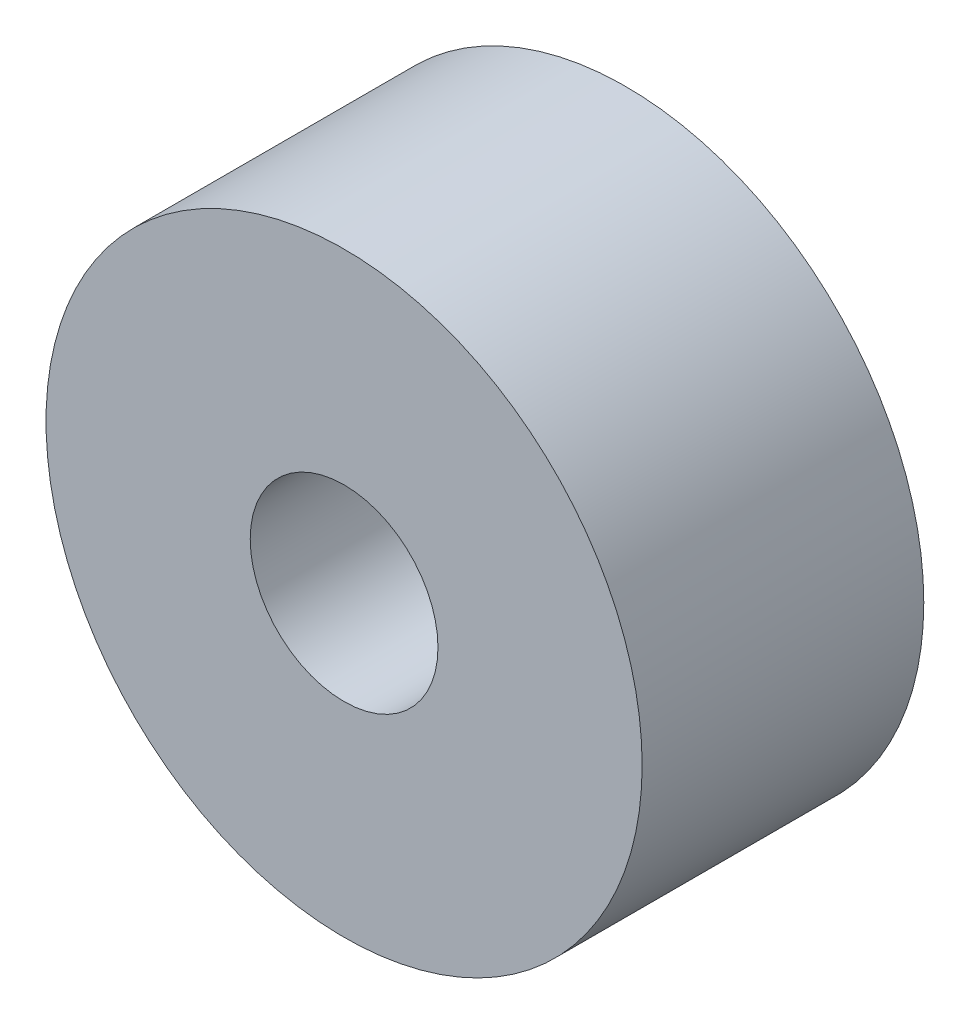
ISO-10303-21;
HEADER;
FILE_DESCRIPTION(('STEP AP214'),'2;1');
FILE_NAME('part.step','',(''),(''),'','','');
FILE_SCHEMA(('AUTOMOTIVE_DESIGN { 1 0 10303 214 1 1 1 1 }'));
ENDSEC;
DATA;
#1=APPLICATION_CONTEXT('core data for automotive mechanical design processes');
#2=APPLICATION_PROTOCOL_DEFINITION('international standard','automotive_design',2000,#1);
#3=PRODUCT_CONTEXT('',#1,'mechanical');
#4=PRODUCT('Part','Part','',(#3));
#5=PRODUCT_RELATED_PRODUCT_CATEGORY('part','',(#4));
#6=PRODUCT_DEFINITION_FORMATION('','',#4);
#7=PRODUCT_DEFINITION_CONTEXT('part definition',#1,'design');
#8=PRODUCT_DEFINITION('design','',#6,#7);
#9=PRODUCT_DEFINITION_SHAPE('','',#8);
#10=(LENGTH_UNIT() NAMED_UNIT(*) SI_UNIT(.MILLI.,.METRE.));
#11=(NAMED_UNIT(*) PLANE_ANGLE_UNIT() SI_UNIT($,.RADIAN.));
#12=(NAMED_UNIT(*) SI_UNIT($,.STERADIAN.) SOLID_ANGLE_UNIT());
#13=UNCERTAINTY_MEASURE_WITH_UNIT(LENGTH_MEASURE(1.E-05),#10,'distance_accuracy_value','');
#14=(GEOMETRIC_REPRESENTATION_CONTEXT(3) GLOBAL_UNCERTAINTY_ASSIGNED_CONTEXT((#13)) GLOBAL_UNIT_ASSIGNED_CONTEXT((#10,
#11,#12)) REPRESENTATION_CONTEXT('',''));
#15=CARTESIAN_POINT('',(0.,0.,0.));
#16=DIRECTION('',(0.,0.,1.));
#17=DIRECTION('',(1.,0.,0.));
#18=AXIS2_PLACEMENT_3D('',#15,#16,#17);
#19=CARTESIAN_POINT('',(0.,0.,3.));
#20=DIRECTION('',(0.,0.,1.));
#21=DIRECTION('',(1.,0.,0.));
#22=AXIS2_PLACEMENT_3D('',#19,#20,#21);
#23=PLANE('',#22);
#24=CARTESIAN_POINT('',(0.,0.,3.));
#25=DIRECTION('',(0.,0.,1.));
#26=DIRECTION('',(1.,0.,0.));
#27=AXIS2_PLACEMENT_3D('',#24,#25,#26);
#28=CIRCLE('',#27,3.175);
#29=CARTESIAN_POINT('',(3.175,0.,3.));
#30=VERTEX_POINT('',#29);
#31=EDGE_CURVE('E10',#30,#30,#28,.T.);
#32=ORIENTED_EDGE('',*,*,#31,.T.);
#33=EDGE_LOOP('',(#32));
#34=FACE_BOUND('',#33,.T.);
#35=CARTESIAN_POINT('',(0.,0.,3.));
#36=DIRECTION('',(0.,0.,1.));
#37=DIRECTION('',(1.,0.,0.));
#38=AXIS2_PLACEMENT_3D('',#35,#36,#37);
#39=CIRCLE('',#38,1.);
#40=CARTESIAN_POINT('',(1.,0.,3.));
#41=VERTEX_POINT('',#40);
#42=EDGE_CURVE('E48',#41,#41,#39,.T.);
#43=ORIENTED_EDGE('',*,*,#42,.F.);
#44=EDGE_LOOP('',(#43));
#45=FACE_BOUND('',#44,.T.);
#46=ADVANCED_FACE('F37',(#34,#45),#23,.T.);
#47=CARTESIAN_POINT('',(0.,0.,0.));
#48=DIRECTION('',(0.,0.,1.));
#49=DIRECTION('',(1.,0.,0.));
#50=AXIS2_PLACEMENT_3D('',#47,#48,#49);
#51=PLANE('',#50);
#52=CARTESIAN_POINT('',(0.,0.,0.));
#53=DIRECTION('',(0.,0.,1.));
#54=DIRECTION('',(1.,0.,0.));
#55=AXIS2_PLACEMENT_3D('',#52,#53,#54);
#56=CIRCLE('',#55,3.175);
#57=CARTESIAN_POINT('',(3.175,0.,0.));
#58=VERTEX_POINT('',#57);
#59=EDGE_CURVE('E41',#58,#58,#56,.T.);
#60=ORIENTED_EDGE('',*,*,#59,.F.);
#61=EDGE_LOOP('',(#60));
#62=FACE_BOUND('',#61,.T.);
#63=CARTESIAN_POINT('',(0.,0.,0.));
#64=DIRECTION('',(0.,0.,1.));
#65=DIRECTION('',(1.,0.,0.));
#66=AXIS2_PLACEMENT_3D('',#63,#64,#65);
#67=CIRCLE('',#66,1.);
#68=CARTESIAN_POINT('',(1.,0.,0.));
#69=VERTEX_POINT('',#68);
#70=EDGE_CURVE('E50',#69,#69,#67,.T.);
#71=ORIENTED_EDGE('',*,*,#70,.T.);
#72=EDGE_LOOP('',(#71));
#73=FACE_BOUND('',#72,.T.);
#74=ADVANCED_FACE('F60',(#62,#73),#51,.F.);
#75=CARTESIAN_POINT('',(0.,0.,3.));
#76=DIRECTION('',(0.,0.,-1.));
#77=DIRECTION('',(-1.,0.,0.));
#78=AXIS2_PLACEMENT_3D('',#75,#76,#77);
#79=CYLINDRICAL_SURFACE('',#78,3.175);
#80=ORIENTED_EDGE('',*,*,#31,.F.);
#81=EDGE_LOOP('',(#80));
#82=FACE_BOUND('',#81,.T.);
#83=ORIENTED_EDGE('',*,*,#59,.T.);
#84=EDGE_LOOP('',(#83));
#85=FACE_BOUND('',#84,.T.);
#86=ADVANCED_FACE('F39',(#82,#85),#79,.T.);
#87=CARTESIAN_POINT('',(0.,0.,3.));
#88=DIRECTION('',(0.,0.,-1.));
#89=DIRECTION('',(-1.,0.,0.));
#90=AXIS2_PLACEMENT_3D('',#87,#88,#89);
#91=CYLINDRICAL_SURFACE('',#90,1.);
#92=ORIENTED_EDGE('',*,*,#42,.T.);
#93=EDGE_LOOP('',(#92));
#94=FACE_BOUND('',#93,.T.);
#95=ORIENTED_EDGE('',*,*,#70,.F.);
#96=EDGE_LOOP('',(#95));
#97=FACE_BOUND('',#96,.T.);
#98=ADVANCED_FACE('F56',(#94,#97),#91,.F.);
#99=CLOSED_SHELL('',(#46,#74,#86,#98));
#100=MANIFOLD_SOLID_BREP('B2',#99);
#101=ADVANCED_BREP_SHAPE_REPRESENTATION('',(#18,#100),#14);
#102=SHAPE_DEFINITION_REPRESENTATION(#9,#101);
ENDSEC;
END-ISO-10303-21;
